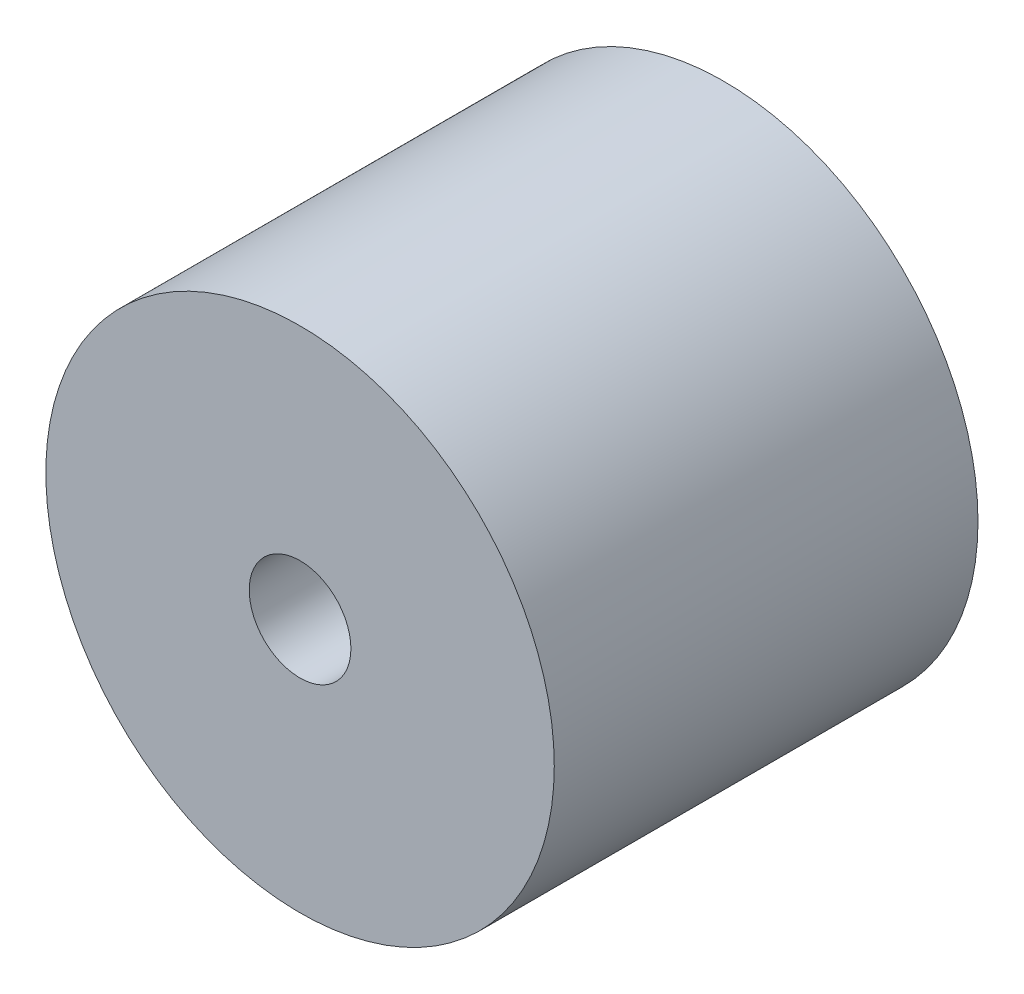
ISO-10303-21;
HEADER;
FILE_DESCRIPTION(('STEP AP214'),'2;1');
FILE_NAME('part.step','',(''),(''),'','','');
FILE_SCHEMA(('AUTOMOTIVE_DESIGN { 1 0 10303 214 1 1 1 1 }'));
ENDSEC;
DATA;
#1=APPLICATION_CONTEXT('core data for automotive mechanical design processes');
#2=APPLICATION_PROTOCOL_DEFINITION('international standard','automotive_design',2000,#1);
#3=PRODUCT_CONTEXT('',#1,'mechanical');
#4=PRODUCT('Part','Part','',(#3));
#5=PRODUCT_RELATED_PRODUCT_CATEGORY('part','',(#4));
#6=PRODUCT_DEFINITION_FORMATION('','',#4);
#7=PRODUCT_DEFINITION_CONTEXT('part definition',#1,'design');
#8=PRODUCT_DEFINITION('design','',#6,#7);
#9=PRODUCT_DEFINITION_SHAPE('','',#8);
#10=(LENGTH_UNIT() NAMED_UNIT(*) SI_UNIT(.MILLI.,.METRE.));
#11=(NAMED_UNIT(*) PLANE_ANGLE_UNIT() SI_UNIT($,.RADIAN.));
#12=(NAMED_UNIT(*) SI_UNIT($,.STERADIAN.) SOLID_ANGLE_UNIT());
#13=UNCERTAINTY_MEASURE_WITH_UNIT(LENGTH_MEASURE(1.E-05),#10,'distance_accuracy_value','');
#14=(GEOMETRIC_REPRESENTATION_CONTEXT(3) GLOBAL_UNCERTAINTY_ASSIGNED_CONTEXT((#13)) GLOBAL_UNIT_ASSIGNED_CONTEXT((#10,
#11,#12)) REPRESENTATION_CONTEXT('',''));
#15=CARTESIAN_POINT('',(0.,0.,0.));
#16=DIRECTION('',(0.,0.,1.));
#17=DIRECTION('',(1.,0.,0.));
#18=AXIS2_PLACEMENT_3D('',#15,#16,#17);
#19=CARTESIAN_POINT('',(0.,0.,250.));
#20=DIRECTION('',(0.,0.,1.));
#21=DIRECTION('',(1.,0.,0.));
#22=AXIS2_PLACEMENT_3D('',#19,#20,#21);
#23=PLANE('',#22);
#24=CARTESIAN_POINT('',(0.,0.,250.));
#25=DIRECTION('',(0.,0.,1.));
#26=DIRECTION('',(1.,0.,0.));
#27=AXIS2_PLACEMENT_3D('',#24,#25,#26);
#28=CIRCLE('',#27,150.);
#29=CARTESIAN_POINT('',(150.,0.,250.));
#30=VERTEX_POINT('',#29);
#31=EDGE_CURVE('E10',#30,#30,#28,.T.);
#32=ORIENTED_EDGE('',*,*,#31,.T.);
#33=EDGE_LOOP('',(#32));
#34=FACE_BOUND('',#33,.T.);
#35=CARTESIAN_POINT('',(0.,0.,250.));
#36=DIRECTION('',(0.,0.,1.));
#37=DIRECTION('',(1.,0.,0.));
#38=AXIS2_PLACEMENT_3D('',#35,#36,#37);
#39=CIRCLE('',#38,30.);
#40=CARTESIAN_POINT('',(30.,0.,250.));
#41=VERTEX_POINT('',#40);
#42=EDGE_CURVE('E56',#41,#41,#39,.T.);
#43=ORIENTED_EDGE('',*,*,#42,.F.);
#44=EDGE_LOOP('',(#43));
#45=FACE_BOUND('',#44,.T.);
#46=ADVANCED_FACE('F27',(#34,#45),#23,.T.);
#47=CARTESIAN_POINT('',(0.,0.,0.));
#48=DIRECTION('',(0.,0.,1.));
#49=DIRECTION('',(1.,0.,0.));
#50=AXIS2_PLACEMENT_3D('',#47,#48,#49);
#51=PLANE('',#50);
#52=CARTESIAN_POINT('',(0.,0.,0.));
#53=DIRECTION('',(0.,0.,1.));
#54=DIRECTION('',(1.,0.,0.));
#55=AXIS2_PLACEMENT_3D('',#52,#53,#54);
#56=CIRCLE('',#55,150.);
#57=CARTESIAN_POINT('',(150.,0.,0.));
#58=VERTEX_POINT('',#57);
#59=EDGE_CURVE('E34',#58,#58,#56,.T.);
#60=ORIENTED_EDGE('',*,*,#59,.F.);
#61=EDGE_LOOP('',(#60));
#62=FACE_BOUND('',#61,.T.);
#63=CARTESIAN_POINT('',(0.,0.,0.));
#64=DIRECTION('',(0.,0.,1.));
#65=DIRECTION('',(1.,0.,0.));
#66=AXIS2_PLACEMENT_3D('',#63,#64,#65);
#67=CIRCLE('',#66,130.);
#68=CARTESIAN_POINT('',(130.,0.,0.));
#69=VERTEX_POINT('',#68);
#70=EDGE_CURVE('E38',#69,#69,#67,.T.);
#71=ORIENTED_EDGE('',*,*,#70,.T.);
#72=EDGE_LOOP('',(#71));
#73=FACE_BOUND('',#72,.T.);
#74=ADVANCED_FACE('F64',(#62,#73),#51,.F.);
#75=CARTESIAN_POINT('',(0.,0.,250.));
#76=DIRECTION('',(0.,0.,-1.));
#77=DIRECTION('',(-1.,0.,0.));
#78=AXIS2_PLACEMENT_3D('',#75,#76,#77);
#79=CYLINDRICAL_SURFACE('',#78,150.);
#80=ORIENTED_EDGE('',*,*,#31,.F.);
#81=EDGE_LOOP('',(#80));
#82=FACE_BOUND('',#81,.T.);
#83=ORIENTED_EDGE('',*,*,#59,.T.);
#84=EDGE_LOOP('',(#83));
#85=FACE_BOUND('',#84,.T.);
#86=ADVANCED_FACE('F29',(#82,#85),#79,.T.);
#87=CARTESIAN_POINT('',(0.,0.,0.));
#88=DIRECTION('',(0.,0.,-1.));
#89=DIRECTION('',(-1.,0.,0.));
#90=AXIS2_PLACEMENT_3D('',#87,#88,#89);
#91=CONICAL_SURFACE('',#90,130.,0.523598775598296);
#92=CARTESIAN_POINT('',(0.,0.,40.));
#93=DIRECTION('',(0.,0.,1.));
#94=DIRECTION('',(1.,0.,0.));
#95=AXIS2_PLACEMENT_3D('',#92,#93,#94);
#96=CIRCLE('',#95,106.905989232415);
#97=CARTESIAN_POINT('',(106.905989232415,0.,40.));
#98=VERTEX_POINT('',#97);
#99=EDGE_CURVE('E42',#98,#98,#96,.T.);
#100=ORIENTED_EDGE('',*,*,#99,.T.);
#101=EDGE_LOOP('',(#100));
#102=FACE_BOUND('',#101,.T.);
#103=ORIENTED_EDGE('',*,*,#70,.F.);
#104=EDGE_LOOP('',(#103));
#105=FACE_BOUND('',#104,.T.);
#106=ADVANCED_FACE('F71',(#102,#105),#91,.F.);
#107=CARTESIAN_POINT('',(-106.905989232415,0.,40.));
#108=DIRECTION('',(0.,0.,-1.));
#109=DIRECTION('',(-1.,0.,0.));
#110=AXIS2_PLACEMENT_3D('',#107,#108,#109);
#111=PLANE('',#110);
#112=CARTESIAN_POINT('',(0.,0.,40.));
#113=DIRECTION('',(0.,0.,1.));
#114=DIRECTION('',(1.,0.,0.));
#115=AXIS2_PLACEMENT_3D('',#112,#113,#114);
#116=CIRCLE('',#115,86.9059892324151);
#117=CARTESIAN_POINT('',(86.9059892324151,0.,40.));
#118=VERTEX_POINT('',#117);
#119=EDGE_CURVE('E47',#118,#118,#116,.T.);
#120=ORIENTED_EDGE('',*,*,#119,.T.);
#121=EDGE_LOOP('',(#120));
#122=FACE_BOUND('',#121,.T.);
#123=ORIENTED_EDGE('',*,*,#99,.F.);
#124=EDGE_LOOP('',(#123));
#125=FACE_BOUND('',#124,.T.);
#126=ADVANCED_FACE('F74',(#122,#125),#111,.T.);
#127=CARTESIAN_POINT('',(0.,0.,40.));
#128=DIRECTION('',(0.,0.,-1.));
#129=DIRECTION('',(-1.,0.,0.));
#130=AXIS2_PLACEMENT_3D('',#127,#128,#129);
#131=CONICAL_SURFACE('',#130,86.9059892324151,0.17453292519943);
#132=CARTESIAN_POINT('',(0.,0.,170.));
#133=DIRECTION('',(0.,0.,1.));
#134=DIRECTION('',(1.,0.,0.));
#135=AXIS2_PLACEMENT_3D('',#132,#133,#134);
#136=CIRCLE('',#135,63.9834817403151);
#137=CARTESIAN_POINT('',(63.9834817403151,0.,170.));
#138=VERTEX_POINT('',#137);
#139=EDGE_CURVE('E50',#138,#138,#136,.T.);
#140=ORIENTED_EDGE('',*,*,#139,.T.);
#141=EDGE_LOOP('',(#140));
#142=FACE_BOUND('',#141,.T.);
#143=ORIENTED_EDGE('',*,*,#119,.F.);
#144=EDGE_LOOP('',(#143));
#145=FACE_BOUND('',#144,.T.);
#146=ADVANCED_FACE('F78',(#142,#145),#131,.F.);
#147=CARTESIAN_POINT('',(-63.9834817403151,0.,170.));
#148=DIRECTION('',(0.,0.,-1.));
#149=DIRECTION('',(-1.,0.,0.));
#150=AXIS2_PLACEMENT_3D('',#147,#148,#149);
#151=PLANE('',#150);
#152=CARTESIAN_POINT('',(0.,0.,170.));
#153=DIRECTION('',(0.,0.,1.));
#154=DIRECTION('',(1.,0.,0.));
#155=AXIS2_PLACEMENT_3D('',#152,#153,#154);
#156=CIRCLE('',#155,30.);
#157=CARTESIAN_POINT('',(30.,0.,170.));
#158=VERTEX_POINT('',#157);
#159=EDGE_CURVE('E53',#158,#158,#156,.T.);
#160=ORIENTED_EDGE('',*,*,#159,.T.);
#161=EDGE_LOOP('',(#160));
#162=FACE_BOUND('',#161,.T.);
#163=ORIENTED_EDGE('',*,*,#139,.F.);
#164=EDGE_LOOP('',(#163));
#165=FACE_BOUND('',#164,.T.);
#166=ADVANCED_FACE('F82',(#162,#165),#151,.T.);
#167=CARTESIAN_POINT('',(0.,0.,0.));
#168=DIRECTION('',(0.,0.,1.));
#169=DIRECTION('',(1.,0.,0.));
#170=AXIS2_PLACEMENT_3D('',#167,#168,#169);
#171=CYLINDRICAL_SURFACE('',#170,30.);
#172=ORIENTED_EDGE('',*,*,#42,.T.);
#173=EDGE_LOOP('',(#172));
#174=FACE_BOUND('',#173,.T.);
#175=ORIENTED_EDGE('',*,*,#159,.F.);
#176=EDGE_LOOP('',(#175));
#177=FACE_BOUND('',#176,.T.);
#178=ADVANCED_FACE('F60',(#174,#177),#171,.F.);
#179=CLOSED_SHELL('',(#46,#74,#86,#106,#126,#146,#166,#178));
#180=MANIFOLD_SOLID_BREP('B2',#179);
#181=ADVANCED_BREP_SHAPE_REPRESENTATION('',(#18,#180),#14);
#182=SHAPE_DEFINITION_REPRESENTATION(#9,#181);
ENDSEC;
END-ISO-10303-21;
